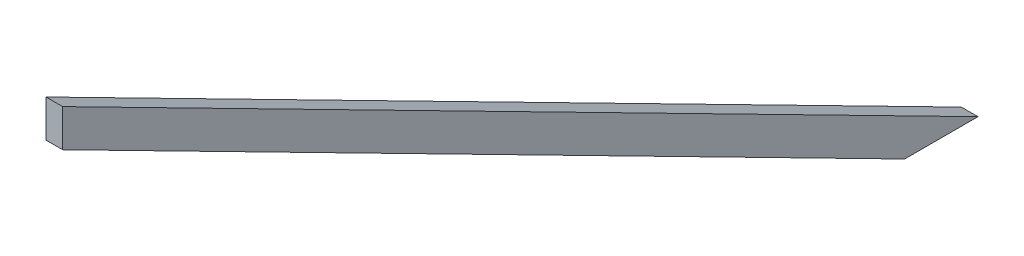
ISO-10303-21;
HEADER;
FILE_DESCRIPTION(('STEP AP214'),'2;1');
FILE_NAME('part.step','',(''),(''),'','','');
FILE_SCHEMA(('AUTOMOTIVE_DESIGN { 1 0 10303 214 1 1 1 1 }'));
ENDSEC;
DATA;
#1=APPLICATION_CONTEXT('core data for automotive mechanical design processes');
#2=APPLICATION_PROTOCOL_DEFINITION('international standard','automotive_design',2000,#1);
#3=PRODUCT_CONTEXT('',#1,'mechanical');
#4=PRODUCT('Part','Part','',(#3));
#5=PRODUCT_RELATED_PRODUCT_CATEGORY('part','',(#4));
#6=PRODUCT_DEFINITION_FORMATION('','',#4);
#7=PRODUCT_DEFINITION_CONTEXT('part definition',#1,'design');
#8=PRODUCT_DEFINITION('design','',#6,#7);
#9=PRODUCT_DEFINITION_SHAPE('','',#8);
#10=(LENGTH_UNIT() NAMED_UNIT(*) SI_UNIT(.MILLI.,.METRE.));
#11=(NAMED_UNIT(*) PLANE_ANGLE_UNIT() SI_UNIT($,.RADIAN.));
#12=(NAMED_UNIT(*) SI_UNIT($,.STERADIAN.) SOLID_ANGLE_UNIT());
#13=UNCERTAINTY_MEASURE_WITH_UNIT(LENGTH_MEASURE(1.E-05),#10,'distance_accuracy_value','');
#14=(GEOMETRIC_REPRESENTATION_CONTEXT(3) GLOBAL_UNCERTAINTY_ASSIGNED_CONTEXT((#13)) GLOBAL_UNIT_ASSIGNED_CONTEXT((#10,
#11,#12)) REPRESENTATION_CONTEXT('',''));
#15=CARTESIAN_POINT('',(0.,0.,0.));
#16=DIRECTION('',(0.,0.,1.));
#17=DIRECTION('',(1.,0.,0.));
#18=AXIS2_PLACEMENT_3D('',#15,#16,#17);
#19=CARTESIAN_POINT('',(5.,-41.0996594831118,-82.2493157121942));
#20=DIRECTION('',(0.,0.,-1.));
#21=DIRECTION('',(-1.,0.,0.));
#22=AXIS2_PLACEMENT_3D('',#19,#20,#21);
#23=PLANE('',#22);
#24=DIRECTION('',(0.,-1.,0.));
#25=VECTOR('',#24,1.);
#26=CARTESIAN_POINT('',(0.,-41.0996594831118,-82.2493157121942));
#27=LINE('',#26,#25);
#28=CARTESIAN_POINT('',(0.,-29.8763971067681,-82.2493157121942));
#29=VERTEX_POINT('',#28);
#30=CARTESIAN_POINT('',(0.,-41.0996594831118,-82.2493157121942));
#31=VERTEX_POINT('',#30);
#32=EDGE_CURVE('E70',#29,#31,#27,.T.);
#33=ORIENTED_EDGE('',*,*,#32,.T.);
#34=DIRECTION('',(-1.,0.,0.));
#35=VECTOR('',#34,1.);
#36=CARTESIAN_POINT('',(5.,-41.0996594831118,-82.2493157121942));
#37=LINE('',#36,#35);
#38=CARTESIAN_POINT('',(5.,-41.0996594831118,-82.2493157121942));
#39=VERTEX_POINT('',#38);
#40=EDGE_CURVE('E11',#39,#31,#37,.T.);
#41=ORIENTED_EDGE('',*,*,#40,.F.);
#42=DIRECTION('',(0.,-1.,0.));
#43=VECTOR('',#42,1.);
#44=CARTESIAN_POINT('',(5.,-41.0996594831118,-82.2493157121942));
#45=LINE('',#44,#43);
#46=CARTESIAN_POINT('',(5.,-29.8763971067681,-82.2493157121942));
#47=VERTEX_POINT('',#46);
#48=EDGE_CURVE('E88',#47,#39,#45,.T.);
#49=ORIENTED_EDGE('',*,*,#48,.F.);
#50=DIRECTION('',(-1.,0.,0.));
#51=VECTOR('',#50,1.);
#52=CARTESIAN_POINT('',(5.,-29.8763971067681,-82.2493157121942));
#53=LINE('',#52,#51);
#54=EDGE_CURVE('E82',#47,#29,#53,.T.);
#55=ORIENTED_EDGE('',*,*,#54,.T.);
#56=EDGE_LOOP('',(#33,#41,#49,#55));
#57=FACE_BOUND('',#56,.T.);
#58=ADVANCED_FACE('F26',(#57),#23,.F.);
#59=CARTESIAN_POINT('',(5.,-41.0996594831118,-82.2493157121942));
#60=DIRECTION('',(0.,0.891006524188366,-0.453990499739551));
#61=DIRECTION('',(0.,0.453990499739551,0.891006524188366));
#62=AXIS2_PLACEMENT_3D('',#59,#60,#61);
#63=PLANE('',#62);
#64=DIRECTION('',(0.,-0.453990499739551,-0.891006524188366));
#65=VECTOR('',#64,1.);
#66=CARTESIAN_POINT('',(0.,-41.0996594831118,-82.2493157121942));
#67=LINE('',#66,#65);
#68=CARTESIAN_POINT('',(0.,-169.968785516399,-335.169216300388));
#69=VERTEX_POINT('',#68);
#70=EDGE_CURVE('E66',#31,#69,#67,.T.);
#71=ORIENTED_EDGE('',*,*,#70,.T.);
#72=DIRECTION('',(-1.,0.,0.));
#73=VECTOR('',#72,1.);
#74=CARTESIAN_POINT('',(5.,-169.968785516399,-335.169216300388));
#75=LINE('',#74,#73);
#76=CARTESIAN_POINT('',(5.,-169.968785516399,-335.169216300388));
#77=VERTEX_POINT('',#76);
#78=EDGE_CURVE('E33',#77,#69,#75,.T.);
#79=ORIENTED_EDGE('',*,*,#78,.F.);
#80=DIRECTION('',(0.,-0.453990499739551,-0.891006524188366));
#81=VECTOR('',#80,1.);
#82=CARTESIAN_POINT('',(5.,-41.0996594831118,-82.2493157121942));
#83=LINE('',#82,#81);
#84=EDGE_CURVE('E78',#39,#77,#83,.T.);
#85=ORIENTED_EDGE('',*,*,#84,.F.);
#86=ORIENTED_EDGE('',*,*,#40,.T.);
#87=EDGE_LOOP('',(#71,#79,#85,#86));
#88=FACE_BOUND('',#87,.T.);
#89=ADVANCED_FACE('F77',(#88),#63,.F.);
#90=CARTESIAN_POINT('',(5.,-169.968785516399,-335.169216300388));
#91=DIRECTION('',(0.,1.,0.));
#92=DIRECTION('',(0.,0.,1.));
#93=AXIS2_PLACEMENT_3D('',#90,#91,#92);
#94=PLANE('',#93);
#95=DIRECTION('',(0.,0.,-1.));
#96=VECTOR('',#95,1.);
#97=CARTESIAN_POINT('',(0.,-169.968785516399,-335.169216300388));
#98=LINE('',#97,#96);
#99=CARTESIAN_POINT('',(0.,-169.968785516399,-357.19610894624));
#100=VERTEX_POINT('',#99);
#101=EDGE_CURVE('E71',#69,#100,#98,.T.);
#102=ORIENTED_EDGE('',*,*,#101,.T.);
#103=DIRECTION('',(-1.,0.,0.));
#104=VECTOR('',#103,1.);
#105=CARTESIAN_POINT('',(5.,-169.968785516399,-357.19610894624));
#106=LINE('',#105,#104);
#107=CARTESIAN_POINT('',(5.,-169.968785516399,-357.19610894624));
#108=VERTEX_POINT('',#107);
#109=EDGE_CURVE('E94',#108,#100,#106,.T.);
#110=ORIENTED_EDGE('',*,*,#109,.F.);
#111=DIRECTION('',(0.,0.,-1.));
#112=VECTOR('',#111,1.);
#113=CARTESIAN_POINT('',(5.,-169.968785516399,-335.169216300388));
#114=LINE('',#113,#112);
#115=EDGE_CURVE('E45',#77,#108,#114,.T.);
#116=ORIENTED_EDGE('',*,*,#115,.F.);
#117=ORIENTED_EDGE('',*,*,#78,.T.);
#118=EDGE_LOOP('',(#102,#110,#116,#117));
#119=FACE_BOUND('',#118,.T.);
#120=ADVANCED_FACE('F97',(#119),#94,.F.);
#121=CARTESIAN_POINT('',(5.,-29.8763971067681,-82.2493157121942));
#122=DIRECTION('',(0.,-0.891006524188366,0.453990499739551));
#123=DIRECTION('',(0.,-0.453990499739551,-0.891006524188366));
#124=AXIS2_PLACEMENT_3D('',#121,#122,#123);
#125=PLANE('',#124);
#126=DIRECTION('',(0.,0.453990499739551,0.891006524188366));
#127=VECTOR('',#126,1.);
#128=CARTESIAN_POINT('',(0.,-29.8763971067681,-82.2493157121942));
#129=LINE('',#128,#127);
#130=EDGE_CURVE('E86',#100,#29,#129,.T.);
#131=ORIENTED_EDGE('',*,*,#130,.T.);
#132=ORIENTED_EDGE('',*,*,#54,.F.);
#133=DIRECTION('',(0.,0.453990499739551,0.891006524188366));
#134=VECTOR('',#133,1.);
#135=CARTESIAN_POINT('',(5.,-29.8763971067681,-82.2493157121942));
#136=LINE('',#135,#134);
#137=EDGE_CURVE('E40',#108,#47,#136,.T.);
#138=ORIENTED_EDGE('',*,*,#137,.F.);
#139=ORIENTED_EDGE('',*,*,#109,.T.);
#140=EDGE_LOOP('',(#131,#132,#138,#139));
#141=FACE_BOUND('',#140,.T.);
#142=ADVANCED_FACE('F99',(#141),#125,.F.);
#143=CARTESIAN_POINT('',(5.,-169.968785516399,-82.2493157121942));
#144=DIRECTION('',(-1.,0.,0.));
#145=DIRECTION('',(0.,0.,1.));
#146=AXIS2_PLACEMENT_3D('',#143,#144,#145);
#147=PLANE('',#146);
#148=ORIENTED_EDGE('',*,*,#48,.T.);
#149=ORIENTED_EDGE('',*,*,#84,.T.);
#150=ORIENTED_EDGE('',*,*,#115,.T.);
#151=ORIENTED_EDGE('',*,*,#137,.T.);
#152=EDGE_LOOP('',(#148,#149,#150,#151));
#153=FACE_BOUND('',#152,.T.);
#154=ADVANCED_FACE('F100',(#153),#147,.F.);
#155=CARTESIAN_POINT('',(0.,-169.968785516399,-82.2493157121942));
#156=DIRECTION('',(-1.,0.,0.));
#157=DIRECTION('',(0.,0.,1.));
#158=AXIS2_PLACEMENT_3D('',#155,#156,#157);
#159=PLANE('',#158);
#160=ORIENTED_EDGE('',*,*,#32,.F.);
#161=ORIENTED_EDGE('',*,*,#130,.F.);
#162=ORIENTED_EDGE('',*,*,#101,.F.);
#163=ORIENTED_EDGE('',*,*,#70,.F.);
#164=EDGE_LOOP('',(#160,#161,#162,#163));
#165=FACE_BOUND('',#164,.T.);
#166=ADVANCED_FACE('F67',(#165),#159,.T.);
#167=CLOSED_SHELL('',(#58,#89,#120,#142,#154,#166));
#168=MANIFOLD_SOLID_BREP('B2',#167);
#169=ADVANCED_BREP_SHAPE_REPRESENTATION('',(#18,#168),#14);
#170=SHAPE_DEFINITION_REPRESENTATION(#9,#169);
ENDSEC;
END-ISO-10303-21;
